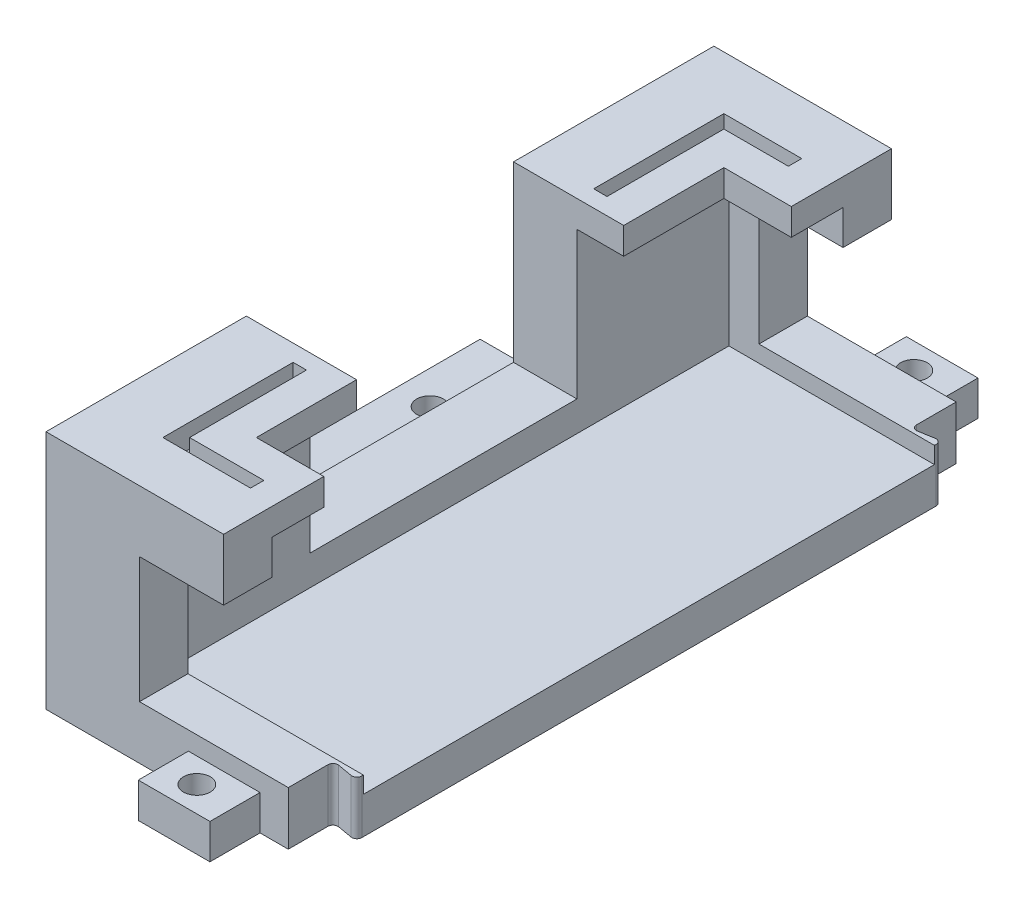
from build123d import *

# Parameters (mm, degrees)
SKETCH1_W                = 369
SKETCH1_H                = 200
BOSS_EXTRUDE1_DEPTH      = 20
SKETCH2_W                = 125
SKETCH2_H                = 16
BOSS_EXTRUDE2_DEPTH      = 12
SKETCH3_W                = 342
SKETCH3_H                = 168
CUT_EXTRUDE1_DEPTH       = 9
SKETCH4_W                = 100
SKETCH4_H                = 12
BOSS_EXTRUDE3_DEPTH      = 60
CUT_EXTRUDE3_START       = -60
CUT_EXTRUDE3_DEPTH       = 70
BOSS_EXTRUDE5_DEPTH      = 40
EXTRUDE_THIN1_DEPTH      = 7
SKETCH10_W               = 404
SKETCH10_H               = 324.796202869
CUT_EXTRUDE4_DEPTH       = 69
CUT_EXTRUDE7_DEPTH       = 282.468026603
CUT_EXTRUDE7_DEPTH_BACK  = 282.468026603
SKETCH14_W               = 41
SKETCH14_H               = 34.717467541
SKETCH12_W               = 50
SKETCH12_H               = 11
BOSS_EXTRUDE6_DEPTH      = 20
SKETCH13_R               = 4
CUT_EXTRUDE6_DEPTH       = 236.671911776
CUT_EXTRUDE9_DEPTH       = 234.504282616
SKETCH16_W               = 15.814467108
SKETCH16_H               = 18.387579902
CUT_EXTRUDE10_DEPTH      = 295.964828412
BOSS_EXTRUDE8_START      = -7
SKETCH18_W               = 7.945182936
SKETCH18_H               = 22.040998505
BOSS_EXTRUDE8_DEPTH      = 7
BOSS_EXTRUDE9_START      = -7
SKETCH19_W               = 10.87781478
SKETCH19_H               = 20.954206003
BOSS_EXTRUDE9_DEPTH      = 7
FILLET1_R                = 1.5
CUT_EXTRUDE11_DEPTH      = 295.964828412
CUT_EXTRUDE11_DEPTH_BACK = 295.964828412
SKETCH20_W               = 10
SKETCH20_H               = 2.9
SKETCH21_W               = 6.852928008
SKETCH21_H               = 52
SKETCH21_W_2             = 5
CUT_EXTRUDE12_DEPTH      = 148.215157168
SKETCH22_W               = 43.183103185
SKETCH22_H               = 12.42943685
CUT_EXTRUDE13_DEPTH      = 295.964828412
BOSS_EXTRUDE10_DEPTH     = 1
CUT_EXTRUDE14_REACH      = 161.042
SKETCH24_W               = 1.5
SKETCH24_H               = 53
SKETCH25_W               = 21.454129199
SKETCH25_H               = 10.485343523
BOSS_EXTRUDE11_DEPTH     = 15
SKETCH26_R               = 4
CUT_EXTRUDE15_DEPTH      = 15
SKETCH27_W               = 8
SKETCH27_H               = 10.57386621
CUT_EXTRUDE16_DEPTH      = 242.209069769


with BuildPart() as part:
    # Sketch1 → Boss-Extrude1 (new body)
    with BuildSketch(Plane(origin=(0, 0, 0), x_dir=(1, 0, 0), z_dir=(0, 1, 0))):
        Rectangle(SKETCH1_W, SKETCH1_H)
    extrude(amount=BOSS_EXTRUDE1_DEPTH)

    # Sketch2 → Boss-Extrude2 (add)
    with BuildSketch(Plane(origin=(0, 20, 0), x_dir=(1, 0, 0), z_dir=(0, 1, 0))):
        Polygon((-184.5, -100), (-151.616556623, -100), (-115.5, -100), (-115.5, -84), (-165.5, -84), (-165.5, -36.5), (-184.5, -36.5), align=None)
        Polygon((-184.5, 100), (-151.616556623, 100), (-115.5, 100), (-115.5, 84), (-165.5, 84), (-165.5, 36.5), (-184.5, 36.5), align=None)
        with Locations((22, -92)):
            Rectangle(SKETCH2_W, SKETCH2_H)
        with Locations((22, 92)):
            Rectangle(SKETCH2_W, SKETCH2_H)
    extrude(amount=BOSS_EXTRUDE2_DEPTH)

    # Sketch3 → Cut-Extrude1 (cut)
    with BuildSketch(Plane(origin=(0, 20, 0), x_dir=(1, 0, 0), z_dir=(0, 1, 0))):
        with Locations((5.5, 0)):
            Rectangle(SKETCH3_W, SKETCH3_H)
    extrude(amount=-CUT_EXTRUDE1_DEPTH, mode=Mode.SUBTRACT)

    # Sketch4 → Boss-Extrude3 (add)
    with BuildSketch(Plane(origin=(0, 0, -100), x_dir=(-1, 0, 0), z_dir=(0, 0, -1))):
        with Locations((-19.5, 26)):
            Rectangle(SKETCH4_W, SKETCH4_H)
    boss_extrude3 = extrude(amount=BOSS_EXTRUDE3_DEPTH)

    # Sketch6 → Cut-Extrude3 (cut)
    with BuildSketch(Plane.XY.offset(-84).offset(CUT_EXTRUDE3_START)):
        with BuildLine():
            Line((-20.5, 32), (-22.787099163, 29.101539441))
            ThreePointArc((-22.787099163, 29.101539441), (-22.9948908, 27.190971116), (-21.366310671, 26.170591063))
            Line((-21.366310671, 26.170591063), (-11.633690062, 26.170591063))
            ThreePointArc((-11.633690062, 26.170591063), (-10.00510936, 27.190970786), (-10.212900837, 29.101539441))
            Line((-10.212900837, 29.101539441), (-12.5, 32))
            Line((-12.5, 32), (-20.5, 32))
        make_face()
        with BuildLine():
            Line((56.5, 32), (54.250139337, 28.697067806))
            ThreePointArc((54.250139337, 28.697067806), (54.153814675, 26.972097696), (55.633689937, 26.080599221))
            Line((55.633689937, 26.080599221), (65.366310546, 26.080599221))
            ThreePointArc((65.366310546, 26.080599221), (66.846185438, 26.972097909), (66.749860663, 28.697067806))
            Line((66.749860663, 28.697067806), (64.5, 32))
            Line((64.5, 32), (56.5, 32))
        make_face()
    cut_extrude3 = extrude(amount=CUT_EXTRUDE3_DEPTH, mode=Mode.SUBTRACT)

    # Sketch8 → Boss-Extrude5 (add)
    with BuildSketch(Plane(origin=(0, 32, 0), x_dir=(1, 0, 0), z_dir=(0, 1, 0))):
        Polygon((-184.5, 36.5), (-165.5, 36.5), (-165.5, 84), (-115.5, 84), (-115.5, 100), (-184.5, 100), align=None)
    boss_extrude5 = extrude(amount=BOSS_EXTRUDE5_DEPTH)

    # Sketch9 → Extrude-Thin1 (add)
    with BuildSketch(Plane(origin=(0, 72, 0), x_dir=(1, 0, 0), z_dir=(0, 1, 0))):
        Polygon((-115.5, 84), (-115.5, 70), (-151.5, 70), (-151.5, 35), (-165.5, 35), (-165.5, 45), (-161.5, 45), (-161.5, 80), (-125.5, 80), (-125.5, 84), align=None)
    extrude_thin1 = extrude(amount=-EXTRUDE_THIN1_DEPTH)

    # Mirror2: Boss-Extrude3, Cut-Extrude3, Boss-Extrude5, Extrude-Thin1 across plane
    add(boss_extrude3.mirror(Plane.XY))
    add(cut_extrude3.mirror(Plane.XY), mode=Mode.SUBTRACT)
    add(boss_extrude5.mirror(Plane.XY))
    add(extrude_thin1.mirror(Plane.XY))

    # Sketch10 → Cut-Extrude4 (cut)
    with BuildSketch(Plane(origin=(0, 32, 0), x_dir=(1, 0, 0), z_dir=(0, 1, 0))):
        with Locations((98.05, -0.89352463)):
            Rectangle(SKETCH10_W, SKETCH10_H)
    extrude(amount=-CUT_EXTRUDE4_DEPTH, mode=Mode.SUBTRACT)

    # Sketch14 → Cut-Extrude7 (cut, two sides: drawn at the far end of the back side and taken through both)
    with BuildSketch(Plane(origin=(0, 0, -100), x_dir=(-1, 0, 0), z_dir=(0, 0, -1)).offset(-CUT_EXTRUDE7_DEPTH_BACK)):
        with Locations((136, 36.253686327)):
            Rectangle(SKETCH14_W, SKETCH14_H)
    extrude(amount=CUT_EXTRUDE7_DEPTH + CUT_EXTRUDE7_DEPTH_BACK, mode=Mode.SUBTRACT)

    # Sketch12 → Boss-Extrude6 (add)
    with BuildSketch(Plane.ZY.offset(184.5)):
        with Locations((-25, 5.5)):
            Rectangle(SKETCH12_W, SKETCH12_H)
    boss_extrude6 = extrude(amount=BOSS_EXTRUDE6_DEPTH)

    # Sketch13 → Cut-Extrude6 (cut, through all)
    with BuildSketch(Plane(origin=(0, 11, 0), x_dir=(1, 0, 0), z_dir=(0, 1, 0))):
        with Locations(Location((-194.5, 25, 0), (0, 0, 270))):
            Circle(SKETCH13_R)
    cut_extrude6 = extrude(amount=-CUT_EXTRUDE6_DEPTH, mode=Mode.SUBTRACT)

    # Mirror3: Boss-Extrude6, Cut-Extrude6 across plane
    add(boss_extrude6.mirror(Plane.XY))
    add(cut_extrude6.mirror(Plane.XY), mode=Mode.SUBTRACT)

    # Sketch11 → Cut-Extrude9 (cut, through all)
    with BuildSketch(Plane(origin=(0, 20, 0), x_dir=(1, 0, 0), z_dir=(0, 1, 0))):
        Polygon((-103.95, 96.25), (-103.95, 87.75), (-111.95, 86.339384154), (-111.95, 97.660615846), align=None)
        Polygon((-103.95, -87.75), (-103.95, -96.25), (-111.95, -97.660615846), (-111.95, -86.339384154), align=None)
    extrude(amount=-CUT_EXTRUDE9_DEPTH, mode=Mode.SUBTRACT)

    # Sketch16 → Cut-Extrude10 (cut, through all)
    with BuildSketch(Plane.XY.offset(100)):
        with Locations((-123.407233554, 62.806210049)):
            Rectangle(SKETCH16_W, SKETCH16_H)
    extrude(amount=-CUT_EXTRUDE10_DEPTH, mode=Mode.SUBTRACT)

    # Sketch18 → Boss-Extrude8 (add)
    with BuildSketch(Plane(origin=(0, 72, 0), x_dir=(1, 0, 0), z_dir=(0, 1, 0)).offset(BOSS_EXTRUDE8_START)):
        with Locations((-135.287058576, -81.020499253)):
            Rectangle(SKETCH18_W, SKETCH18_H)
    extrude(amount=BOSS_EXTRUDE8_DEPTH)

    # Sketch19 → Boss-Extrude9 (add)
    with BuildSketch(Plane(origin=(0, 72, 0), x_dir=(1, 0, 0), z_dir=(0, 1, 0)).offset(BOSS_EXTRUDE9_START)):
        with Locations((-136.753374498, 80.477103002)):
            Rectangle(SKETCH19_W, SKETCH19_H)
    extrude(amount=BOSS_EXTRUDE9_DEPTH)

    # Fillet1
    fillet1_edges = [part.edges().sort_by_distance(p)[0] for p in [
        (-111.95, 10, -97.660615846),
        (-103.95, 10, -96.25),
        (-103.95, 10, -87.75),
        (-111.95, 10, -86.339384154),
        (-111.95, 10, 97.660615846),
        (-111.95, 10, 86.339384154),
        (-103.95, 10, 87.75),
        (-103.95, 10, 96.25),
    ]]
    fillet(fillet1_edges, radius=FILLET1_R)

    # Sketch20 → Cut-Extrude11 (cut, two sides: drawn at the far end of the back side and taken through both)
    with BuildSketch(Plane.XY.offset(100).offset(-CUT_EXTRUDE11_DEPTH_BACK)):
        with Locations((-151.5, 17.444952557)):
            Rectangle(SKETCH20_W, SKETCH20_H)
    extrude(amount=CUT_EXTRUDE11_DEPTH + CUT_EXTRUDE11_DEPTH_BACK, mode=Mode.SUBTRACT)

    # Sketch21 → Cut-Extrude12 (cut, through all)
    with BuildSketch(Plane.ZY.offset(184.5)):
        with Locations((-36.573535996, 46)):
            Rectangle(SKETCH21_W, SKETCH21_H)
        with Locations((37.5, 46)):
            Rectangle(SKETCH21_W_2, SKETCH21_H)
    extrude(amount=-CUT_EXTRUDE12_DEPTH, mode=Mode.SUBTRACT)

    # Sketch22 → Cut-Extrude13 (cut, through all)
    with BuildSketch(Plane.XY.offset(100)):
        with Locations((-124.908448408, 22.209670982)):
            Rectangle(SKETCH22_W, SKETCH22_H)
    extrude(amount=-CUT_EXTRUDE13_DEPTH, mode=Mode.SUBTRACT)

    # Sketch23 → Boss-Extrude10 (add)
    with BuildSketch(Plane(origin=(0, 65, 0), x_dir=(-1, 0, 0), z_dir=(0, -1, 0))):
        Polygon((151.5, -70), (131.314467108, -70), (131.314467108, -84), (156.173141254, -84), (165.5, -84), (165.5, -71.5), (165.5, -40), (151.5, -40), align=None)
    boss_extrude10 = extrude(amount=BOSS_EXTRUDE10_DEPTH)

    # Mirror4: Boss-Extrude10 across plane
    add(boss_extrude10.mirror(Plane.XY))

    # Cut-Extrude14: up to this face of the body (flat: up to its plane)
    cut_extrude14_end = Plane(part.part.faces().sort_by_distance((-165.5, 68.5, -64.5))[0])
    # Sketch24 → Cut-Extrude14 (cut, up to the picked face)
    with BuildSketch(Plane(origin=(-103.95, 0, 0), x_dir=(0, 0, -1), z_dir=(1, 0, 0)), mode=Mode.PRIVATE) as cut_extrude14_sk1:
        with Locations((-84.75, 37.5)):
            Rectangle(SKETCH24_W, SKETCH24_H)
    cut_extrude14_tool1 = split(extrude(cut_extrude14_sk1.sketch, amount=-CUT_EXTRUDE14_REACH, mode=Mode.PRIVATE), bisect_by=cut_extrude14_end, keep=Keep.BOTH, mode=Mode.PRIVATE)
    cut_extrude14 = cut_extrude14_tool1.solids().sort_by(Axis((-103.95, 37.5, 84.75), (-1, 0, 0)))[0]
    add(cut_extrude14, mode=Mode.SUBTRACT)

    # Mirror5: Cut-Extrude14 across plane
    add(cut_extrude14.mirror(Plane.XY), mode=Mode.SUBTRACT)

    # Sketch25 → Boss-Extrude11 (add)
    with BuildSketch(Plane.XY.offset(100)):
        with Locations((-131.134538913, 5.242671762)):
            Rectangle(SKETCH25_W, SKETCH25_H)
    boss_extrude11 = extrude(amount=BOSS_EXTRUDE11_DEPTH)

    # Sketch26 → Cut-Extrude15 (cut)
    with BuildSketch(Plane(origin=(0, 10.485343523, 0), x_dir=(1, 0, 0), z_dir=(0, 1, 0))):
        with Locations(Location((-131.966394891, -107.35881059, 0), (0, 0, 270))):
            Circle(SKETCH26_R)
    cut_extrude15 = extrude(amount=-CUT_EXTRUDE15_DEPTH, mode=Mode.SUBTRACT)

    # Sketch27 → Cut-Extrude16 (cut, through all)
    with BuildSketch(Plane(origin=(0, 15.994952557, 0), x_dir=(1, 0, 0), z_dir=(0, 1, 0))):
        with Locations((-107.95, -94.713066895)):
            Rectangle(SKETCH27_W, SKETCH27_H)
    cut_extrude16 = extrude(amount=-CUT_EXTRUDE16_DEPTH, mode=Mode.SUBTRACT)

    # Mirror6: Boss-Extrude11, Cut-Extrude15, Cut-Extrude16 across plane
    add(boss_extrude11.mirror(Plane.XY))
    add(cut_extrude15.mirror(Plane.XY), mode=Mode.SUBTRACT)
    add(cut_extrude16.mirror(Plane.XY), mode=Mode.SUBTRACT)


solid = part.part
